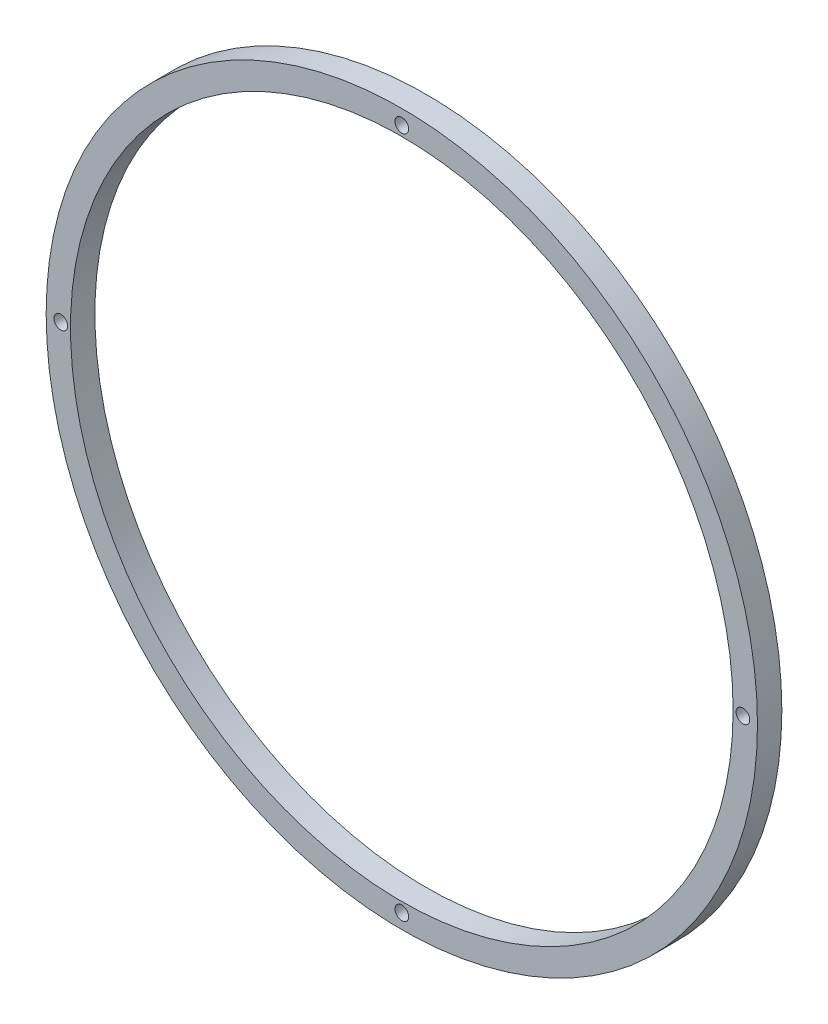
from build123d import *

# Parameters (mm, degrees)
SKETCH1_R           = 92.71
SKETCH1_R_2         = 1.7859375
SKETCH1_R_3         = 86.36
BOSS_EXTRUDE1_DEPTH = 6.35


with BuildPart() as part:
    # Sketch1 → Boss-Extrude1 (new body)
    with BuildSketch(Plane.XY):
        Circle(SKETCH1_R)
        with Locations((-88.9, 0)):
            Circle(SKETCH1_R_2, mode=Mode.SUBTRACT)
        with Locations((0, -88.9)):
            Circle(SKETCH1_R_2, mode=Mode.SUBTRACT)
        with Locations((88.9, 0)):
            Circle(SKETCH1_R_2, mode=Mode.SUBTRACT)
        with Locations((0, 88.9)):
            Circle(SKETCH1_R_2, mode=Mode.SUBTRACT)
        Circle(SKETCH1_R_3, mode=Mode.SUBTRACT)
    extrude(amount=BOSS_EXTRUDE1_DEPTH)


solid = part.part
